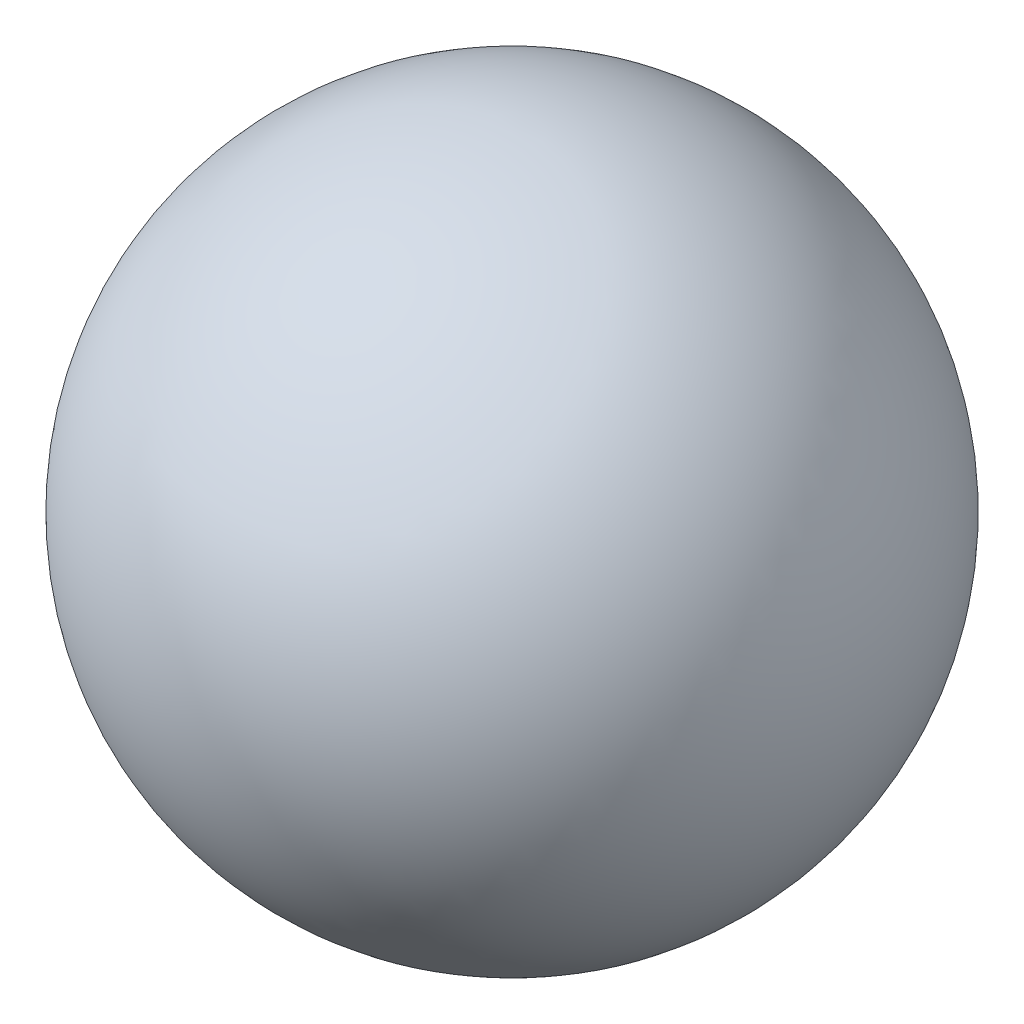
ISO-10303-21;
HEADER;
FILE_DESCRIPTION(('STEP AP214'),'2;1');
FILE_NAME('part.step','',(''),(''),'','','');
FILE_SCHEMA(('AUTOMOTIVE_DESIGN { 1 0 10303 214 1 1 1 1 }'));
ENDSEC;
DATA;
#1=APPLICATION_CONTEXT('core data for automotive mechanical design processes');
#2=APPLICATION_PROTOCOL_DEFINITION('international standard','automotive_design',2000,#1);
#3=PRODUCT_CONTEXT('',#1,'mechanical');
#4=PRODUCT('Part','Part','',(#3));
#5=PRODUCT_RELATED_PRODUCT_CATEGORY('part','',(#4));
#6=PRODUCT_DEFINITION_FORMATION('','',#4);
#7=PRODUCT_DEFINITION_CONTEXT('part definition',#1,'design');
#8=PRODUCT_DEFINITION('design','',#6,#7);
#9=PRODUCT_DEFINITION_SHAPE('','',#8);
#10=(LENGTH_UNIT() NAMED_UNIT(*) SI_UNIT(.MILLI.,.METRE.));
#11=(NAMED_UNIT(*) PLANE_ANGLE_UNIT() SI_UNIT($,.RADIAN.));
#12=(NAMED_UNIT(*) SI_UNIT($,.STERADIAN.) SOLID_ANGLE_UNIT());
#13=UNCERTAINTY_MEASURE_WITH_UNIT(LENGTH_MEASURE(1.E-05),#10,'distance_accuracy_value','');
#14=(GEOMETRIC_REPRESENTATION_CONTEXT(3) GLOBAL_UNCERTAINTY_ASSIGNED_CONTEXT((#13)) GLOBAL_UNIT_ASSIGNED_CONTEXT((#10,
#11,#12)) REPRESENTATION_CONTEXT('',''));
#15=CARTESIAN_POINT('',(0.,0.,0.));
#16=DIRECTION('',(0.,0.,1.));
#17=DIRECTION('',(1.,0.,0.));
#18=AXIS2_PLACEMENT_3D('',#15,#16,#17);
#19=CARTESIAN_POINT('',(0.,0.,0.));
#20=DIRECTION('',(0.,1.,0.));
#21=DIRECTION('',(1.,0.,0.));
#22=AXIS2_PLACEMENT_3D('',#19,#20,#21);
#23=SPHERICAL_SURFACE('',#22,4.5);
#24=CARTESIAN_POINT('',(0.,4.5,0.));
#25=VERTEX_POINT('',#24);
#26=VERTEX_LOOP('',#25);
#27=FACE_BOUND('',#26,.T.);
#28=ADVANCED_FACE('F25',(#27),#23,.T.);
#29=CLOSED_SHELL('',(#28));
#30=MANIFOLD_SOLID_BREP('B2',#29);
#31=ADVANCED_BREP_SHAPE_REPRESENTATION('',(#18,#30),#14);
#32=SHAPE_DEFINITION_REPRESENTATION(#9,#31);
ENDSEC;
END-ISO-10303-21;
